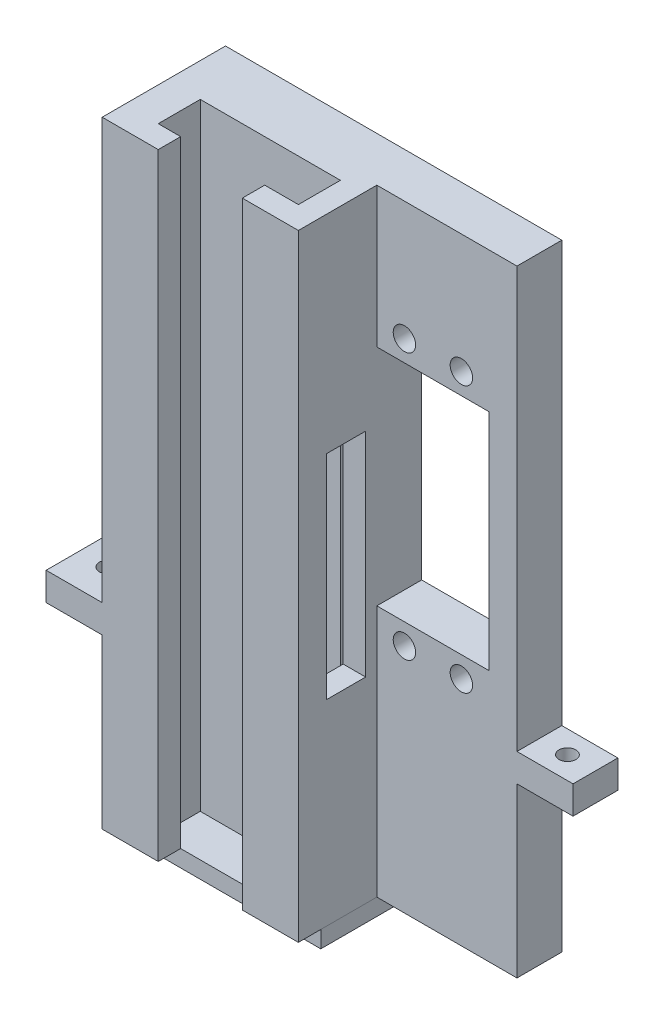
from build123d import *

# Parameters (mm, degrees)
BOSS_EXTRUDE1_DEPTH      = 40
BOSS_EXTRUDE1_DEPTH_BACK = 70
SKETCH2_W                = 7
SKETCH2_H                = 38
CUT_EXTRUDE6_DEPTH       = 30
SKETCH10_W               = 25
SKETCH10_H               = 110
BOSS_EXTRUDE3_DEPTH      = 8
SKETCH11_W               = 20
SKETCH11_H               = 40
CUT_EXTRUDE9_DEPTH       = 10
BOSS_EXTRUDE4_START      = -110
BOSS_EXTRUDE4_DEPTH      = 110
CUT_EXTRUDE11_REACH      = 86.795
CUT_EXTRUDE12_REACH      = 86.795
SKETCH15_R               = 2
SKETCH16_W               = 35
SKETCH16_H               = 18
BOSS_EXTRUDE5_DEPTH      = 3
SKETCH17_W               = 10
SKETCH17_H               = 22
SKETCH17_R               = 1.5
SKETCH17_H_2             = 8
BOSS_EXTRUDE6_DEPTH      = 5


with BuildPart() as part:
    # Sketch1 → Boss-Extrude1 (new, two sides: drawn at the far end of the back side and taken through both)
    with BuildSketch(Plane(origin=(0, 0, 0), x_dir=(1, 0, 0), z_dir=(0, 1, 0)).offset(-BOSS_EXTRUDE1_DEPTH_BACK)):
        Polygon((7.5, -10), (13.5, -10), (13.5, 0), (-13.5, 0), (-13.5, -10), (-7.5, -10), (-7.5, -14), (-17.5, -14), (-17.5, 8), (17.5, 8), (17.5, -14), (7.5, -14), align=None)
    extrude(amount=BOSS_EXTRUDE1_DEPTH + BOSS_EXTRUDE1_DEPTH_BACK)

    # Sketch2 → Cut-Extrude6 (cut)
    with BuildSketch(Plane(origin=(17.5, 0, 0), x_dir=(0, 0, -1), z_dir=(1, 0, 0))):
        with Locations((-5.5, -16)):
            Rectangle(SKETCH2_W, SKETCH2_H)
    extrude(amount=-CUT_EXTRUDE6_DEPTH, mode=Mode.SUBTRACT)

    # Sketch10 → Boss-Extrude3 (add)
    with BuildSketch(Plane(origin=(0, 0, -8), x_dir=(-1, 0, 0), z_dir=(0, 0, -1))):
        with Locations((-30, -15)):
            Rectangle(SKETCH10_W, SKETCH10_H)
    extrude(amount=-BOSS_EXTRUDE3_DEPTH)

    # Sketch11 → Cut-Extrude9 (cut)
    with BuildSketch(Plane(origin=(0, 0, -8), x_dir=(-1, 0, 0), z_dir=(0, 0, -1))):
        with Locations((-27.5, -5)):
            Rectangle(SKETCH11_W, SKETCH11_H)
    extrude(amount=-CUT_EXTRUDE9_DEPTH, mode=Mode.SUBTRACT)

    # Sketch13 → Boss-Extrude4 (add)
    with BuildSketch(Plane(origin=(0, 40, 0), x_dir=(1, 0, 0), z_dir=(0, 1, 0)).offset(BOSS_EXTRUDE4_START)):
        Polygon((-11.5, -10), (-13.5, -10), (-13.5, 0), (13.5, 0), (13.5, -2.5), (-11.5, -2.5), align=None)
    extrude(amount=BOSS_EXTRUDE4_DEPTH)

    # Sketch14 → Cut-Extrude11 (cut, up to next)
    with BuildSketch(Plane(origin=(0, 0, -8), x_dir=(-1, 0, 0), z_dir=(0, 0, -1)), mode=Mode.PRIVATE) as cut_extrude11_sk1:
        with BuildLine():
            Line((-2.5, -25), (-2.5, 25))
            ThreePointArc((-2.5, 25), (0, 27.5), (2.5, 25))
            Line((2.5, 25), (2.5, -25))
            ThreePointArc((2.5, -25), (0, -27.5), (-2.5, -25))
        make_face()
    cut_extrude11_tool1 = extrude(cut_extrude11_sk1.sketch, amount=-CUT_EXTRUDE11_REACH, mode=Mode.PRIVATE) & part.part
    add(cut_extrude11_tool1.solids().sort_by_distance((0, 0, -8))[0], mode=Mode.SUBTRACT)

    # Sketch15 → Cut-Extrude12 (cut, up to next)
    with BuildSketch(Plane(origin=(0, 0, -8), x_dir=(-1, 0, 0), z_dir=(0, 0, -1)), mode=Mode.PRIVATE) as cut_extrude12_sk1:
        with Locations((-22.42, 18.749)):
            Circle(SKETCH15_R)
    cut_extrude12_tool1 = extrude(cut_extrude12_sk1.sketch, amount=-CUT_EXTRUDE12_REACH, mode=Mode.PRIVATE) & part.part
    # Sketch15 → Cut-Extrude12 (cut, up to next)
    with BuildSketch(Plane(origin=(0, 0, -8), x_dir=(-1, 0, 0), z_dir=(0, 0, -1)), mode=Mode.PRIVATE) as cut_extrude12_sk2:
        with Locations((-32.58, 18.749)):
            Circle(SKETCH15_R)
    cut_extrude12_tool2 = extrude(cut_extrude12_sk2.sketch, amount=-CUT_EXTRUDE12_REACH, mode=Mode.PRIVATE) & part.part
    # Sketch15 → Cut-Extrude12 (cut, up to next)
    with BuildSketch(Plane(origin=(0, 0, -8), x_dir=(-1, 0, 0), z_dir=(0, 0, -1)), mode=Mode.PRIVATE) as cut_extrude12_sk3:
        with Locations((-22.42, -28.749)):
            Circle(SKETCH15_R)
    cut_extrude12_tool3 = extrude(cut_extrude12_sk3.sketch, amount=-CUT_EXTRUDE12_REACH, mode=Mode.PRIVATE) & part.part
    # Sketch15 → Cut-Extrude12 (cut, up to next)
    with BuildSketch(Plane(origin=(0, 0, -8), x_dir=(-1, 0, 0), z_dir=(0, 0, -1)), mode=Mode.PRIVATE) as cut_extrude12_sk4:
        with Locations((-32.58, -28.749)):
            Circle(SKETCH15_R)
    cut_extrude12_tool4 = extrude(cut_extrude12_sk4.sketch, amount=-CUT_EXTRUDE12_REACH, mode=Mode.PRIVATE) & part.part
    add(cut_extrude12_tool1.solids().sort_by_distance((22.42, 18.749, -8))[0], mode=Mode.SUBTRACT)
    add(cut_extrude12_tool2.solids().sort_by_distance((32.58, 18.749, -8))[0], mode=Mode.SUBTRACT)
    add(cut_extrude12_tool3.solids().sort_by_distance((22.42, -28.749, -8))[0], mode=Mode.SUBTRACT)
    add(cut_extrude12_tool4.solids().sort_by_distance((32.58, -28.749, -8))[0], mode=Mode.SUBTRACT)

    # Sketch17 → Boss-Extrude6 (add)
    # profile 1 of 2: a face of its own
    with BuildSketch(Plane(origin=(0, -35, 0), x_dir=(-1, 0, 0), z_dir=(0, -1, 0))):
        with Locations((22.5, -3)):
            Rectangle(SKETCH17_W, SKETCH17_H)
        with Locations(Location((22.5, -8, 0), (0, 0, 90))):
            Circle(SKETCH17_R, mode=Mode.SUBTRACT)
        with Locations(Location((22.5, 2, 0), (0, 0, 90))):
            Circle(SKETCH17_R, mode=Mode.SUBTRACT)
    # profile 2 of 2: a face of its own
    with BuildSketch(Plane(origin=(0, -35, 0), x_dir=(-1, 0, 0), z_dir=(0, -1, 0))):
        with Locations((-47.5, 4)):
            Rectangle(SKETCH17_W, SKETCH17_H_2)
        with Locations(Location((-47.5, 4, 0), (0, 0, 90))):
            Circle(SKETCH17_R, mode=Mode.SUBTRACT)
    extrude(amount=BOSS_EXTRUDE6_DEPTH)


with BuildPart() as body_2:
    # Sketch16 → Boss-Extrude5 (new body)
    with BuildSketch(Plane.XZ.offset(70)):
        with Locations((0, 1)):
            Rectangle(SKETCH16_W, SKETCH16_H)
    extrude(amount=BOSS_EXTRUDE5_DEPTH)


solid = Compound([part.part, body_2.part])
